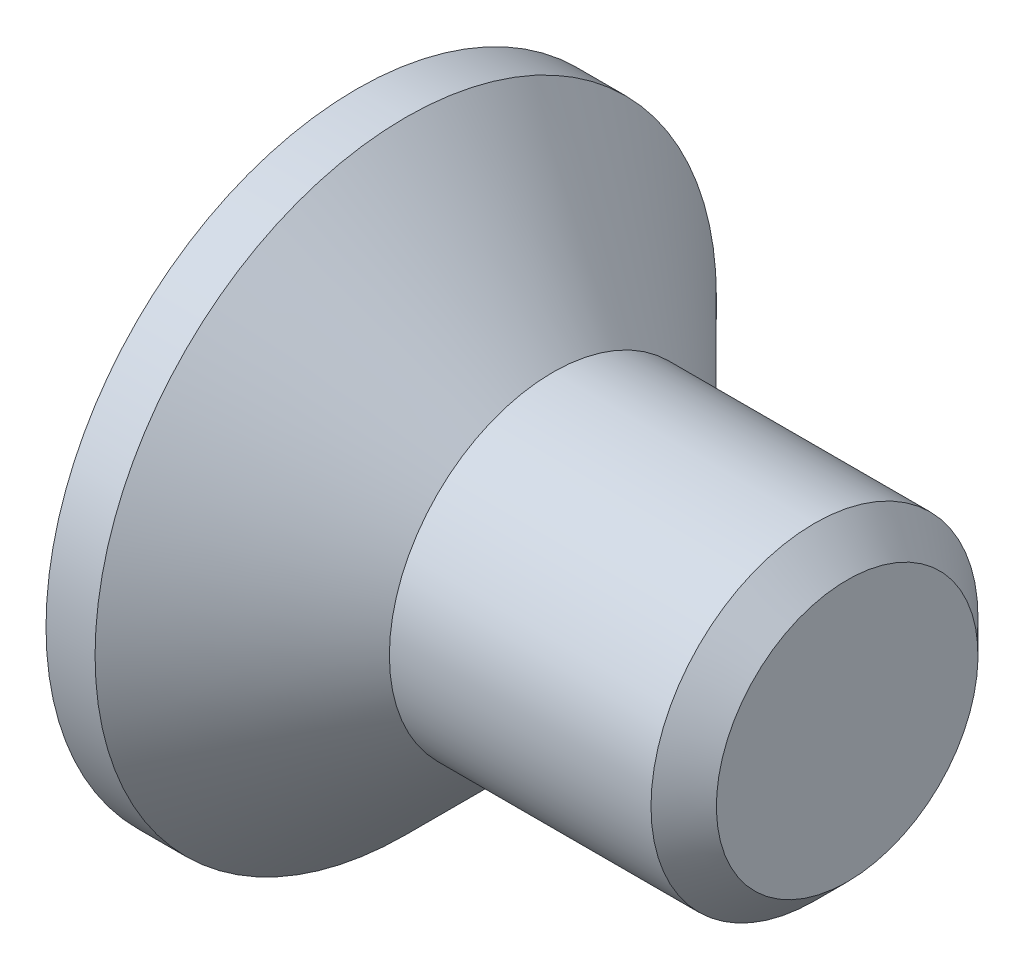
ISO-10303-21;
HEADER;
FILE_DESCRIPTION(('STEP AP214'),'2;1');
FILE_NAME('part.step','',(''),(''),'','','');
FILE_SCHEMA(('AUTOMOTIVE_DESIGN { 1 0 10303 214 1 1 1 1 }'));
ENDSEC;
DATA;
#1=APPLICATION_CONTEXT('core data for automotive mechanical design processes');
#2=APPLICATION_PROTOCOL_DEFINITION('international standard','automotive_design',2000,#1);
#3=PRODUCT_CONTEXT('',#1,'mechanical');
#4=PRODUCT('Part','Part','',(#3));
#5=PRODUCT_RELATED_PRODUCT_CATEGORY('part','',(#4));
#6=PRODUCT_DEFINITION_FORMATION('','',#4);
#7=PRODUCT_DEFINITION_CONTEXT('part definition',#1,'design');
#8=PRODUCT_DEFINITION('design','',#6,#7);
#9=PRODUCT_DEFINITION_SHAPE('','',#8);
#10=(LENGTH_UNIT() NAMED_UNIT(*) SI_UNIT(.MILLI.,.METRE.));
#11=(NAMED_UNIT(*) PLANE_ANGLE_UNIT() SI_UNIT($,.RADIAN.));
#12=(NAMED_UNIT(*) SI_UNIT($,.STERADIAN.) SOLID_ANGLE_UNIT());
#13=UNCERTAINTY_MEASURE_WITH_UNIT(LENGTH_MEASURE(1.E-05),#10,'distance_accuracy_value','');
#14=(GEOMETRIC_REPRESENTATION_CONTEXT(3) GLOBAL_UNCERTAINTY_ASSIGNED_CONTEXT((#13)) GLOBAL_UNIT_ASSIGNED_CONTEXT((#10,
#11,#12)) REPRESENTATION_CONTEXT('',''));
#15=CARTESIAN_POINT('',(0.,0.,0.));
#16=DIRECTION('',(0.,0.,1.));
#17=DIRECTION('',(1.,0.,0.));
#18=AXIS2_PLACEMENT_3D('',#15,#16,#17);
#19=CARTESIAN_POINT('',(0.,0.,0.));
#20=DIRECTION('',(-1.,0.,0.));
#21=DIRECTION('',(0.,-1.,0.));
#22=AXIS2_PLACEMENT_3D('',#19,#20,#21);
#23=CONICAL_SURFACE('',#22,1.,0.78539816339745);
#24=CARTESIAN_POINT('',(-0.899999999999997,0.,0.));
#25=DIRECTION('',(-1.,0.,0.));
#26=DIRECTION('',(0.,-1.,0.));
#27=AXIS2_PLACEMENT_3D('',#24,#25,#26);
#28=CIRCLE('',#27,1.9);
#29=CARTESIAN_POINT('',(-0.899999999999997,-1.9,0.));
#30=VERTEX_POINT('',#29);
#31=EDGE_CURVE('E189',#30,#30,#28,.T.);
#32=ORIENTED_EDGE('',*,*,#31,.F.);
#33=EDGE_LOOP('',(#32));
#34=FACE_BOUND('',#33,.T.);
#35=CARTESIAN_POINT('',(0.,0.,0.));
#36=DIRECTION('',(-1.,0.,0.));
#37=DIRECTION('',(0.,-1.,0.));
#38=AXIS2_PLACEMENT_3D('',#35,#36,#37);
#39=CIRCLE('',#38,1.);
#40=CARTESIAN_POINT('',(0.,-1.,0.));
#41=VERTEX_POINT('',#40);
#42=EDGE_CURVE('E212',#41,#41,#39,.T.);
#43=ORIENTED_EDGE('',*,*,#42,.T.);
#44=EDGE_LOOP('',(#43));
#45=FACE_BOUND('',#44,.T.);
#46=ADVANCED_FACE('F33',(#34,#45),#23,.T.);
#47=CARTESIAN_POINT('',(-1.2,0.,0.));
#48=DIRECTION('',(-1.,0.,0.));
#49=DIRECTION('',(0.,-1.,0.));
#50=AXIS2_PLACEMENT_3D('',#47,#48,#49);
#51=CYLINDRICAL_SURFACE('',#50,1.);
#52=CARTESIAN_POINT('',(1.6,0.,0.));
#53=DIRECTION('',(-1.,0.,0.));
#54=DIRECTION('',(0.,-1.,0.));
#55=AXIS2_PLACEMENT_3D('',#52,#53,#54);
#56=CIRCLE('',#55,1.);
#57=CARTESIAN_POINT('',(1.6,-1.,0.));
#58=VERTEX_POINT('',#57);
#59=EDGE_CURVE('E41',#58,#58,#56,.T.);
#60=ORIENTED_EDGE('',*,*,#59,.T.);
#61=EDGE_LOOP('',(#60));
#62=FACE_BOUND('',#61,.T.);
#63=ORIENTED_EDGE('',*,*,#42,.F.);
#64=EDGE_LOOP('',(#63));
#65=FACE_BOUND('',#64,.T.);
#66=ADVANCED_FACE('F217',(#62,#65),#51,.T.);
#67=CARTESIAN_POINT('',(1.8,0.,0.));
#68=DIRECTION('',(-1.,0.,0.));
#69=DIRECTION('',(0.,-1.,0.));
#70=AXIS2_PLACEMENT_3D('',#67,#68,#69);
#71=PLANE('',#70);
#72=CARTESIAN_POINT('',(1.8,0.,0.));
#73=DIRECTION('',(-1.,0.,0.));
#74=DIRECTION('',(0.,-1.,0.));
#75=AXIS2_PLACEMENT_3D('',#72,#73,#74);
#76=CIRCLE('',#75,0.800000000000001);
#77=CARTESIAN_POINT('',(1.8,-0.800000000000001,0.));
#78=VERTEX_POINT('',#77);
#79=EDGE_CURVE('E11',#78,#78,#76,.F.);
#80=ORIENTED_EDGE('',*,*,#79,.T.);
#81=EDGE_LOOP('',(#80));
#82=FACE_BOUND('',#81,.T.);
#83=ADVANCED_FACE('F240',(#82),#71,.F.);
#84=CARTESIAN_POINT('',(-1.2,1.9,0.));
#85=DIRECTION('',(1.,0.,0.));
#86=DIRECTION('',(0.,1.,0.));
#87=AXIS2_PLACEMENT_3D('',#84,#85,#86);
#88=PLANE('',#87);
#89=DIRECTION('',(0.,0.,-1.));
#90=VECTOR('',#89,1.);
#91=CARTESIAN_POINT('',(-1.2,0.3,-1.175));
#92=LINE('',#91,#90);
#93=CARTESIAN_POINT('',(-1.2,0.3,-0.3));
#94=VERTEX_POINT('',#93);
#95=CARTESIAN_POINT('',(-1.2,0.3,-1.175));
#96=VERTEX_POINT('',#95);
#97=EDGE_CURVE('E158',#94,#96,#92,.T.);
#98=ORIENTED_EDGE('',*,*,#97,.F.);
#99=DIRECTION('',(0.,-1.,0.));
#100=VECTOR('',#99,1.);
#101=CARTESIAN_POINT('',(-1.2,0.3,-0.3));
#102=LINE('',#101,#100);
#103=CARTESIAN_POINT('',(-1.2,1.175,-0.3));
#104=VERTEX_POINT('',#103);
#105=EDGE_CURVE('E48',#104,#94,#102,.T.);
#106=ORIENTED_EDGE('',*,*,#105,.F.);
#107=DIRECTION('',(0.,0.,-1.));
#108=VECTOR('',#107,1.);
#109=CARTESIAN_POINT('',(-1.2,1.175,-0.3));
#110=LINE('',#109,#108);
#111=CARTESIAN_POINT('',(-1.2,1.175,0.3));
#112=VERTEX_POINT('',#111);
#113=EDGE_CURVE('E185',#112,#104,#110,.T.);
#114=ORIENTED_EDGE('',*,*,#113,.F.);
#115=DIRECTION('',(0.,1.,0.));
#116=VECTOR('',#115,1.);
#117=CARTESIAN_POINT('',(-1.2,1.175,0.3));
#118=LINE('',#117,#116);
#119=CARTESIAN_POINT('',(-1.2,0.3,0.3));
#120=VERTEX_POINT('',#119);
#121=EDGE_CURVE('E183',#120,#112,#118,.T.);
#122=ORIENTED_EDGE('',*,*,#121,.F.);
#123=DIRECTION('',(0.,0.,-1.));
#124=VECTOR('',#123,1.);
#125=CARTESIAN_POINT('',(-1.2,0.3,0.3));
#126=LINE('',#125,#124);
#127=CARTESIAN_POINT('',(-1.2,0.3,1.175));
#128=VERTEX_POINT('',#127);
#129=EDGE_CURVE('E132',#128,#120,#126,.T.);
#130=ORIENTED_EDGE('',*,*,#129,.F.);
#131=DIRECTION('',(0.,1.,0.));
#132=VECTOR('',#131,1.);
#133=CARTESIAN_POINT('',(-1.2,0.3,1.175));
#134=LINE('',#133,#132);
#135=CARTESIAN_POINT('',(-1.2,-0.3,1.175));
#136=VERTEX_POINT('',#135);
#137=EDGE_CURVE('E179',#136,#128,#134,.T.);
#138=ORIENTED_EDGE('',*,*,#137,.F.);
#139=DIRECTION('',(0.,0.,1.));
#140=VECTOR('',#139,1.);
#141=CARTESIAN_POINT('',(-1.2,-0.3,1.175));
#142=LINE('',#141,#140);
#143=CARTESIAN_POINT('',(-1.2,-0.3,0.3));
#144=VERTEX_POINT('',#143);
#145=EDGE_CURVE('E176',#144,#136,#142,.T.);
#146=ORIENTED_EDGE('',*,*,#145,.F.);
#147=DIRECTION('',(0.,1.,0.));
#148=VECTOR('',#147,1.);
#149=CARTESIAN_POINT('',(-1.2,-0.3,0.3));
#150=LINE('',#149,#148);
#151=CARTESIAN_POINT('',(-1.2,-1.175,0.3));
#152=VERTEX_POINT('',#151);
#153=EDGE_CURVE('E173',#152,#144,#150,.T.);
#154=ORIENTED_EDGE('',*,*,#153,.F.);
#155=DIRECTION('',(0.,0.,1.));
#156=VECTOR('',#155,1.);
#157=CARTESIAN_POINT('',(-1.2,-1.175,0.3));
#158=LINE('',#157,#156);
#159=CARTESIAN_POINT('',(-1.2,-1.175,-0.3));
#160=VERTEX_POINT('',#159);
#161=EDGE_CURVE('E170',#160,#152,#158,.T.);
#162=ORIENTED_EDGE('',*,*,#161,.F.);
#163=DIRECTION('',(0.,-1.,0.));
#164=VECTOR('',#163,1.);
#165=CARTESIAN_POINT('',(-1.2,-1.175,-0.3));
#166=LINE('',#165,#164);
#167=CARTESIAN_POINT('',(-1.2,-0.3,-0.3));
#168=VERTEX_POINT('',#167);
#169=EDGE_CURVE('E167',#168,#160,#166,.T.);
#170=ORIENTED_EDGE('',*,*,#169,.F.);
#171=DIRECTION('',(0.,0.,1.));
#172=VECTOR('',#171,1.);
#173=CARTESIAN_POINT('',(-1.2,-0.3,-0.3));
#174=LINE('',#173,#172);
#175=CARTESIAN_POINT('',(-1.2,-0.3,-1.175));
#176=VERTEX_POINT('',#175);
#177=EDGE_CURVE('E164',#176,#168,#174,.T.);
#178=ORIENTED_EDGE('',*,*,#177,.F.);
#179=DIRECTION('',(0.,-1.,0.));
#180=VECTOR('',#179,1.);
#181=CARTESIAN_POINT('',(-1.2,-0.3,-1.175));
#182=LINE('',#181,#180);
#183=EDGE_CURVE('E161',#96,#176,#182,.T.);
#184=ORIENTED_EDGE('',*,*,#183,.F.);
#185=EDGE_LOOP('',(#98,#106,#114,#122,#130,#138,#146,#154,#162,#170,#178,#184));
#186=FACE_BOUND('',#185,.T.);
#187=CARTESIAN_POINT('',(-1.2,0.,0.));
#188=DIRECTION('',(-1.,0.,0.));
#189=DIRECTION('',(0.,-1.,0.));
#190=AXIS2_PLACEMENT_3D('',#187,#188,#189);
#191=CIRCLE('',#190,1.9);
#192=CARTESIAN_POINT('',(-1.2,-1.9,0.));
#193=VERTEX_POINT('',#192);
#194=EDGE_CURVE('E209',#193,#193,#191,.T.);
#195=ORIENTED_EDGE('',*,*,#194,.T.);
#196=EDGE_LOOP('',(#195));
#197=FACE_BOUND('',#196,.T.);
#198=ADVANCED_FACE('F230',(#186,#197),#88,.F.);
#199=CARTESIAN_POINT('',(-1.2,0.,0.));
#200=DIRECTION('',(-1.,0.,0.));
#201=DIRECTION('',(0.,-1.,0.));
#202=AXIS2_PLACEMENT_3D('',#199,#200,#201);
#203=CYLINDRICAL_SURFACE('',#202,1.9);
#204=ORIENTED_EDGE('',*,*,#194,.F.);
#205=EDGE_LOOP('',(#204));
#206=FACE_BOUND('',#205,.T.);
#207=ORIENTED_EDGE('',*,*,#31,.T.);
#208=EDGE_LOOP('',(#207));
#209=FACE_BOUND('',#208,.T.);
#210=ADVANCED_FACE('F222',(#206,#209),#203,.T.);
#211=CARTESIAN_POINT('',(1.6,0.,0.));
#212=DIRECTION('',(-1.,0.,0.));
#213=DIRECTION('',(0.,-1.,0.));
#214=AXIS2_PLACEMENT_3D('',#211,#212,#213);
#215=CONICAL_SURFACE('',#214,1.,0.785398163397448);
#216=CARTESIAN_POINT('',(1.8,-0.800000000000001,0.));
#217=CARTESIAN_POINT('',(1.79791666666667,-0.802083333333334,0.));
#218=CARTESIAN_POINT('',(1.79583333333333,-0.804166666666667,0.));
#219=CARTESIAN_POINT('',(1.79166666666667,-0.808333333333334,0.));
#220=CARTESIAN_POINT('',(1.78958333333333,-0.810416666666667,0.));
#221=CARTESIAN_POINT('',(1.78541666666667,-0.814583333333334,0.));
#222=CARTESIAN_POINT('',(1.78333333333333,-0.816666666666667,0.));
#223=CARTESIAN_POINT('',(1.77916666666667,-0.820833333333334,0.));
#224=CARTESIAN_POINT('',(1.77708333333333,-0.822916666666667,0.));
#225=CARTESIAN_POINT('',(1.77291666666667,-0.827083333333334,0.));
#226=CARTESIAN_POINT('',(1.77083333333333,-0.829166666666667,0.));
#227=CARTESIAN_POINT('',(1.76666666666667,-0.833333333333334,0.));
#228=CARTESIAN_POINT('',(1.76458333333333,-0.835416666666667,0.));
#229=CARTESIAN_POINT('',(1.76041666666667,-0.839583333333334,0.));
#230=CARTESIAN_POINT('',(1.75833333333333,-0.841666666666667,0.));
#231=CARTESIAN_POINT('',(1.75416666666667,-0.845833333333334,0.));
#232=CARTESIAN_POINT('',(1.75208333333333,-0.847916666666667,0.));
#233=CARTESIAN_POINT('',(1.74791666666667,-0.852083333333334,0.));
#234=CARTESIAN_POINT('',(1.74583333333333,-0.854166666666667,0.));
#235=CARTESIAN_POINT('',(1.74166666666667,-0.858333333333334,0.));
#236=CARTESIAN_POINT('',(1.73958333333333,-0.860416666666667,0.));
#237=CARTESIAN_POINT('',(1.73541666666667,-0.864583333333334,0.));
#238=CARTESIAN_POINT('',(1.73333333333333,-0.866666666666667,0.));
#239=CARTESIAN_POINT('',(1.72916666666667,-0.870833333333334,0.));
#240=CARTESIAN_POINT('',(1.72708333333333,-0.872916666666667,0.));
#241=CARTESIAN_POINT('',(1.72291666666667,-0.877083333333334,0.));
#242=CARTESIAN_POINT('',(1.72083333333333,-0.879166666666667,0.));
#243=CARTESIAN_POINT('',(1.71666666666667,-0.883333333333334,0.));
#244=CARTESIAN_POINT('',(1.71458333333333,-0.885416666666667,0.));
#245=CARTESIAN_POINT('',(1.71041666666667,-0.889583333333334,0.));
#246=CARTESIAN_POINT('',(1.70833333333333,-0.891666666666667,0.));
#247=CARTESIAN_POINT('',(1.70416666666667,-0.895833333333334,0.));
#248=CARTESIAN_POINT('',(1.70208333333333,-0.897916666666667,0.));
#249=CARTESIAN_POINT('',(1.69791666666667,-0.902083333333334,0.));
#250=CARTESIAN_POINT('',(1.69583333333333,-0.904166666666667,0.));
#251=CARTESIAN_POINT('',(1.69166666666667,-0.908333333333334,0.));
#252=CARTESIAN_POINT('',(1.68958333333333,-0.910416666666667,0.));
#253=CARTESIAN_POINT('',(1.68541666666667,-0.914583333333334,0.));
#254=CARTESIAN_POINT('',(1.68333333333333,-0.916666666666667,0.));
#255=CARTESIAN_POINT('',(1.67916666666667,-0.920833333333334,0.));
#256=CARTESIAN_POINT('',(1.67708333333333,-0.922916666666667,0.));
#257=CARTESIAN_POINT('',(1.67291666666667,-0.927083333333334,0.));
#258=CARTESIAN_POINT('',(1.67083333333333,-0.929166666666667,0.));
#259=CARTESIAN_POINT('',(1.66666666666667,-0.933333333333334,0.));
#260=CARTESIAN_POINT('',(1.66458333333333,-0.935416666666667,0.));
#261=CARTESIAN_POINT('',(1.66041666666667,-0.939583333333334,0.));
#262=CARTESIAN_POINT('',(1.65833333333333,-0.941666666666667,0.));
#263=CARTESIAN_POINT('',(1.65416666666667,-0.945833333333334,0.));
#264=CARTESIAN_POINT('',(1.65208333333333,-0.947916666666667,0.));
#265=CARTESIAN_POINT('',(1.64791666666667,-0.952083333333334,0.));
#266=CARTESIAN_POINT('',(1.64583333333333,-0.954166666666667,0.));
#267=CARTESIAN_POINT('',(1.64166666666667,-0.958333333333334,0.));
#268=CARTESIAN_POINT('',(1.63958333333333,-0.960416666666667,0.));
#269=CARTESIAN_POINT('',(1.63541666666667,-0.964583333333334,0.));
#270=CARTESIAN_POINT('',(1.63333333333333,-0.966666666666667,0.));
#271=CARTESIAN_POINT('',(1.62916666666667,-0.970833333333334,0.));
#272=CARTESIAN_POINT('',(1.62708333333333,-0.972916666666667,0.));
#273=CARTESIAN_POINT('',(1.62291666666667,-0.977083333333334,0.));
#274=CARTESIAN_POINT('',(1.62083333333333,-0.979166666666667,0.));
#275=CARTESIAN_POINT('',(1.61666666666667,-0.983333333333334,0.));
#276=CARTESIAN_POINT('',(1.61458333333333,-0.985416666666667,0.));
#277=CARTESIAN_POINT('',(1.61041666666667,-0.989583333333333,0.));
#278=CARTESIAN_POINT('',(1.60833333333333,-0.991666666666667,0.));
#279=CARTESIAN_POINT('',(1.60416666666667,-0.995833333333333,0.));
#280=CARTESIAN_POINT('',(1.60208333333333,-0.997916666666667,0.));
#281=CARTESIAN_POINT('',(1.6,-1.,0.));
#282=B_SPLINE_CURVE_WITH_KNOTS('',3,(#216,#217,#218,#219,#220,#221,#222,#223,#224,#225,#226,
#227,#228,#229,#230,#231,#232,#233,#234,#235,#236,#237,#238,#239,#240,#241,#242,#243,#244,#245,
#246,#247,#248,#249,#250,#251,#252,#253,#254,#255,#256,#257,#258,#259,#260,#261,#262,#263,#264,
#265,#266,#267,#268,#269,#270,#271,#272,#273,#274,#275,#276,#277,#278,#279,#280,#281),
.UNSPECIFIED.,.F.,.F.,(4,2,2,2,2,2,2,2,2,2,2,2,2,2,2,2,2,2,2,2,2,2,2,2,2,2,2,2,2,2,2,2,4),(0.,
0.00883883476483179,0.0176776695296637,0.0265165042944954,0.0353553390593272,0.044194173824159,
0.0530330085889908,0.0618718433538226,0.0707106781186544,0.0795495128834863,0.0883883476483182,
0.09722718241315,0.106066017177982,0.114904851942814,0.123743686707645,0.132582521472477,
0.141421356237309,0.150260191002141,0.159099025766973,0.167937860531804,0.176776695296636,
0.185615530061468,0.1944543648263,0.203293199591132,0.212132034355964,0.220970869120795,
0.229809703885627,0.238648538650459,0.247487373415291,0.256326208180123,0.265165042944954,
0.274003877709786,0.282842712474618),.UNSPECIFIED.);
#283=EDGE_CURVE('BSEAM35',#78,#58,#282,.T.);
#284=ORIENTED_EDGE('',*,*,#79,.F.);
#285=ORIENTED_EDGE('',*,*,#59,.F.);
#286=ORIENTED_EDGE('',*,*,#283,.T.);
#287=ORIENTED_EDGE('',*,*,#283,.F.);
#288=EDGE_LOOP('',(#284,#286,#285,#287));
#289=FACE_BOUND('',#288,.T.);
#290=ADVANCED_FACE('F35',(#289),#215,.T.);
#291=CARTESIAN_POINT('',(-0.249999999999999,0.3,-0.3));
#292=DIRECTION('',(0.,0.,-1.));
#293=DIRECTION('',(0.,1.,0.));
#294=AXIS2_PLACEMENT_3D('',#291,#292,#293);
#295=PLANE('',#294);
#296=ORIENTED_EDGE('',*,*,#105,.T.);
#297=DIRECTION('',(-1.,0.,0.));
#298=VECTOR('',#297,1.);
#299=CARTESIAN_POINT('',(-0.249999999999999,0.3,-0.3));
#300=LINE('',#299,#298);
#301=CARTESIAN_POINT('',(-0.249999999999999,0.3,-0.3));
#302=VERTEX_POINT('',#301);
#303=EDGE_CURVE('E96',#302,#94,#300,.T.);
#304=ORIENTED_EDGE('',*,*,#303,.F.);
#305=DIRECTION('',(0.,-1.,0.));
#306=VECTOR('',#305,1.);
#307=CARTESIAN_POINT('',(-0.249999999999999,0.3,-0.3));
#308=LINE('',#307,#306);
#309=CARTESIAN_POINT('',(-0.249999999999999,1.175,-0.3));
#310=VERTEX_POINT('',#309);
#311=EDGE_CURVE('E187',#310,#302,#308,.T.);
#312=ORIENTED_EDGE('',*,*,#311,.F.);
#313=DIRECTION('',(-1.,0.,0.));
#314=VECTOR('',#313,1.);
#315=CARTESIAN_POINT('',(-0.249999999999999,1.175,-0.3));
#316=LINE('',#315,#314);
#317=EDGE_CURVE('E56',#310,#104,#316,.T.);
#318=ORIENTED_EDGE('',*,*,#317,.T.);
#319=EDGE_LOOP('',(#296,#304,#312,#318));
#320=FACE_BOUND('',#319,.T.);
#321=ADVANCED_FACE('F221',(#320),#295,.F.);
#322=CARTESIAN_POINT('',(-0.249999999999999,1.175,-0.3));
#323=DIRECTION('',(0.,1.,0.));
#324=DIRECTION('',(-1.,0.,0.));
#325=AXIS2_PLACEMENT_3D('',#322,#323,#324);
#326=PLANE('',#325);
#327=ORIENTED_EDGE('',*,*,#113,.T.);
#328=ORIENTED_EDGE('',*,*,#317,.F.);
#329=DIRECTION('',(0.,0.,-1.));
#330=VECTOR('',#329,1.);
#331=CARTESIAN_POINT('',(-0.249999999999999,1.175,-0.3));
#332=LINE('',#331,#330);
#333=CARTESIAN_POINT('',(-0.249999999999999,1.175,0.3));
#334=VERTEX_POINT('',#333);
#335=EDGE_CURVE('E144',#334,#310,#332,.T.);
#336=ORIENTED_EDGE('',*,*,#335,.F.);
#337=DIRECTION('',(-1.,0.,0.));
#338=VECTOR('',#337,1.);
#339=CARTESIAN_POINT('',(-0.249999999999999,1.175,0.3));
#340=LINE('',#339,#338);
#341=EDGE_CURVE('E136',#334,#112,#340,.T.);
#342=ORIENTED_EDGE('',*,*,#341,.T.);
#343=EDGE_LOOP('',(#327,#328,#336,#342));
#344=FACE_BOUND('',#343,.T.);
#345=ADVANCED_FACE('F228',(#344),#326,.F.);
#346=CARTESIAN_POINT('',(-0.249999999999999,1.175,0.3));
#347=DIRECTION('',(0.,0.,1.));
#348=DIRECTION('',(0.,-1.,0.));
#349=AXIS2_PLACEMENT_3D('',#346,#347,#348);
#350=PLANE('',#349);
#351=ORIENTED_EDGE('',*,*,#121,.T.);
#352=ORIENTED_EDGE('',*,*,#341,.F.);
#353=DIRECTION('',(0.,1.,0.));
#354=VECTOR('',#353,1.);
#355=CARTESIAN_POINT('',(-0.249999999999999,1.175,0.3));
#356=LINE('',#355,#354);
#357=CARTESIAN_POINT('',(-0.249999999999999,0.3,0.3));
#358=VERTEX_POINT('',#357);
#359=EDGE_CURVE('E140',#358,#334,#356,.T.);
#360=ORIENTED_EDGE('',*,*,#359,.F.);
#361=DIRECTION('',(-1.,0.,0.));
#362=VECTOR('',#361,1.);
#363=CARTESIAN_POINT('',(-0.249999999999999,0.3,0.3));
#364=LINE('',#363,#362);
#365=EDGE_CURVE('E125',#358,#120,#364,.T.);
#366=ORIENTED_EDGE('',*,*,#365,.T.);
#367=EDGE_LOOP('',(#351,#352,#360,#366));
#368=FACE_BOUND('',#367,.T.);
#369=ADVANCED_FACE('F141',(#368),#350,.F.);
#370=CARTESIAN_POINT('',(-0.249999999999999,0.3,0.3));
#371=DIRECTION('',(0.,1.,0.));
#372=DIRECTION('',(0.,0.,1.));
#373=AXIS2_PLACEMENT_3D('',#370,#371,#372);
#374=PLANE('',#373);
#375=ORIENTED_EDGE('',*,*,#129,.T.);
#376=ORIENTED_EDGE('',*,*,#365,.F.);
#377=DIRECTION('',(0.,0.,-1.));
#378=VECTOR('',#377,1.);
#379=CARTESIAN_POINT('',(-0.249999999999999,0.3,0.3));
#380=LINE('',#379,#378);
#381=CARTESIAN_POINT('',(-0.249999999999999,0.3,1.175));
#382=VERTEX_POINT('',#381);
#383=EDGE_CURVE('E129',#382,#358,#380,.T.);
#384=ORIENTED_EDGE('',*,*,#383,.F.);
#385=DIRECTION('',(-1.,0.,0.));
#386=VECTOR('',#385,1.);
#387=CARTESIAN_POINT('',(-0.249999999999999,0.3,1.175));
#388=LINE('',#387,#386);
#389=EDGE_CURVE('E137',#382,#128,#388,.T.);
#390=ORIENTED_EDGE('',*,*,#389,.T.);
#391=EDGE_LOOP('',(#375,#376,#384,#390));
#392=FACE_BOUND('',#391,.T.);
#393=ADVANCED_FACE('F127',(#392),#374,.F.);
#394=CARTESIAN_POINT('',(-0.249999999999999,0.3,1.175));
#395=DIRECTION('',(0.,0.,1.));
#396=DIRECTION('',(1.,0.,0.));
#397=AXIS2_PLACEMENT_3D('',#394,#395,#396);
#398=PLANE('',#397);
#399=ORIENTED_EDGE('',*,*,#137,.T.);
#400=ORIENTED_EDGE('',*,*,#389,.F.);
#401=DIRECTION('',(0.,1.,0.));
#402=VECTOR('',#401,1.);
#403=CARTESIAN_POINT('',(-0.249999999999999,0.3,1.175));
#404=LINE('',#403,#402);
#405=CARTESIAN_POINT('',(-0.249999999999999,-0.3,1.175));
#406=VERTEX_POINT('',#405);
#407=EDGE_CURVE('E150',#406,#382,#404,.T.);
#408=ORIENTED_EDGE('',*,*,#407,.F.);
#409=DIRECTION('',(-1.,0.,0.));
#410=VECTOR('',#409,1.);
#411=CARTESIAN_POINT('',(-0.249999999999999,-0.3,1.175));
#412=LINE('',#411,#410);
#413=EDGE_CURVE('E192',#406,#136,#412,.T.);
#414=ORIENTED_EDGE('',*,*,#413,.T.);
#415=EDGE_LOOP('',(#399,#400,#408,#414));
#416=FACE_BOUND('',#415,.T.);
#417=ADVANCED_FACE('F278',(#416),#398,.F.);
#418=CARTESIAN_POINT('',(-0.249999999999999,-0.3,1.175));
#419=DIRECTION('',(0.,-1.,0.));
#420=DIRECTION('',(0.,0.,-1.));
#421=AXIS2_PLACEMENT_3D('',#418,#419,#420);
#422=PLANE('',#421);
#423=ORIENTED_EDGE('',*,*,#145,.T.);
#424=ORIENTED_EDGE('',*,*,#413,.F.);
#425=DIRECTION('',(0.,0.,1.));
#426=VECTOR('',#425,1.);
#427=CARTESIAN_POINT('',(-0.249999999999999,-0.3,1.175));
#428=LINE('',#427,#426);
#429=CARTESIAN_POINT('',(-0.249999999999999,-0.3,0.3));
#430=VERTEX_POINT('',#429);
#431=EDGE_CURVE('E152',#430,#406,#428,.T.);
#432=ORIENTED_EDGE('',*,*,#431,.F.);
#433=DIRECTION('',(-1.,0.,0.));
#434=VECTOR('',#433,1.);
#435=CARTESIAN_POINT('',(-0.249999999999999,-0.3,0.3));
#436=LINE('',#435,#434);
#437=EDGE_CURVE('E194',#430,#144,#436,.T.);
#438=ORIENTED_EDGE('',*,*,#437,.T.);
#439=EDGE_LOOP('',(#423,#424,#432,#438));
#440=FACE_BOUND('',#439,.T.);
#441=ADVANCED_FACE('F274',(#440),#422,.F.);
#442=CARTESIAN_POINT('',(-0.249999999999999,-0.3,0.3));
#443=DIRECTION('',(0.,0.,1.));
#444=DIRECTION('',(1.,0.,0.));
#445=AXIS2_PLACEMENT_3D('',#442,#443,#444);
#446=PLANE('',#445);
#447=ORIENTED_EDGE('',*,*,#153,.T.);
#448=ORIENTED_EDGE('',*,*,#437,.F.);
#449=DIRECTION('',(0.,1.,0.));
#450=VECTOR('',#449,1.);
#451=CARTESIAN_POINT('',(-0.249999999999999,-0.3,0.3));
#452=LINE('',#451,#450);
#453=CARTESIAN_POINT('',(-0.249999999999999,-1.175,0.3));
#454=VERTEX_POINT('',#453);
#455=EDGE_CURVE('E422',#454,#430,#452,.T.);
#456=ORIENTED_EDGE('',*,*,#455,.F.);
#457=DIRECTION('',(-1.,0.,0.));
#458=VECTOR('',#457,1.);
#459=CARTESIAN_POINT('',(-0.249999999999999,-1.175,0.3));
#460=LINE('',#459,#458);
#461=EDGE_CURVE('E196',#454,#152,#460,.T.);
#462=ORIENTED_EDGE('',*,*,#461,.T.);
#463=EDGE_LOOP('',(#447,#448,#456,#462));
#464=FACE_BOUND('',#463,.T.);
#465=ADVANCED_FACE('F270',(#464),#446,.F.);
#466=CARTESIAN_POINT('',(-0.249999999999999,-1.175,0.3));
#467=DIRECTION('',(0.,-1.,0.));
#468=DIRECTION('',(1.,0.,0.));
#469=AXIS2_PLACEMENT_3D('',#466,#467,#468);
#470=PLANE('',#469);
#471=ORIENTED_EDGE('',*,*,#161,.T.);
#472=ORIENTED_EDGE('',*,*,#461,.F.);
#473=DIRECTION('',(0.,0.,1.));
#474=VECTOR('',#473,1.);
#475=CARTESIAN_POINT('',(-0.249999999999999,-1.175,0.3));
#476=LINE('',#475,#474);
#477=CARTESIAN_POINT('',(-0.249999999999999,-1.175,-0.3));
#478=VERTEX_POINT('',#477);
#479=EDGE_CURVE('E419',#478,#454,#476,.T.);
#480=ORIENTED_EDGE('',*,*,#479,.F.);
#481=DIRECTION('',(-1.,0.,0.));
#482=VECTOR('',#481,1.);
#483=CARTESIAN_POINT('',(-0.249999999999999,-1.175,-0.3));
#484=LINE('',#483,#482);
#485=EDGE_CURVE('E198',#478,#160,#484,.T.);
#486=ORIENTED_EDGE('',*,*,#485,.T.);
#487=EDGE_LOOP('',(#471,#472,#480,#486));
#488=FACE_BOUND('',#487,.T.);
#489=ADVANCED_FACE('F266',(#488),#470,.F.);
#490=CARTESIAN_POINT('',(-0.249999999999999,-1.175,-0.3));
#491=DIRECTION('',(0.,0.,-1.));
#492=DIRECTION('',(0.,1.,0.));
#493=AXIS2_PLACEMENT_3D('',#490,#491,#492);
#494=PLANE('',#493);
#495=ORIENTED_EDGE('',*,*,#169,.T.);
#496=ORIENTED_EDGE('',*,*,#485,.F.);
#497=DIRECTION('',(0.,-1.,0.));
#498=VECTOR('',#497,1.);
#499=CARTESIAN_POINT('',(-0.249999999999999,-1.175,-0.3));
#500=LINE('',#499,#498);
#501=CARTESIAN_POINT('',(-0.249999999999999,-0.3,-0.3));
#502=VERTEX_POINT('',#501);
#503=EDGE_CURVE('E416',#502,#478,#500,.T.);
#504=ORIENTED_EDGE('',*,*,#503,.F.);
#505=DIRECTION('',(-1.,0.,0.));
#506=VECTOR('',#505,1.);
#507=CARTESIAN_POINT('',(-0.249999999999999,-0.3,-0.3));
#508=LINE('',#507,#506);
#509=EDGE_CURVE('E200',#502,#168,#508,.T.);
#510=ORIENTED_EDGE('',*,*,#509,.T.);
#511=EDGE_LOOP('',(#495,#496,#504,#510));
#512=FACE_BOUND('',#511,.T.);
#513=ADVANCED_FACE('F262',(#512),#494,.F.);
#514=CARTESIAN_POINT('',(-0.249999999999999,-0.3,-0.3));
#515=DIRECTION('',(0.,-1.,0.));
#516=DIRECTION('',(0.,0.,-1.));
#517=AXIS2_PLACEMENT_3D('',#514,#515,#516);
#518=PLANE('',#517);
#519=ORIENTED_EDGE('',*,*,#177,.T.);
#520=ORIENTED_EDGE('',*,*,#509,.F.);
#521=DIRECTION('',(0.,0.,1.));
#522=VECTOR('',#521,1.);
#523=CARTESIAN_POINT('',(-0.249999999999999,-0.3,-0.3));
#524=LINE('',#523,#522);
#525=CARTESIAN_POINT('',(-0.249999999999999,-0.3,-1.175));
#526=VERTEX_POINT('',#525);
#527=EDGE_CURVE('E413',#526,#502,#524,.T.);
#528=ORIENTED_EDGE('',*,*,#527,.F.);
#529=DIRECTION('',(-1.,0.,0.));
#530=VECTOR('',#529,1.);
#531=CARTESIAN_POINT('',(-0.249999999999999,-0.3,-1.175));
#532=LINE('',#531,#530);
#533=EDGE_CURVE('E202',#526,#176,#532,.T.);
#534=ORIENTED_EDGE('',*,*,#533,.T.);
#535=EDGE_LOOP('',(#519,#520,#528,#534));
#536=FACE_BOUND('',#535,.T.);
#537=ADVANCED_FACE('F258',(#536),#518,.F.);
#538=CARTESIAN_POINT('',(-0.249999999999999,-0.3,-1.175));
#539=DIRECTION('',(0.,0.,-1.));
#540=DIRECTION('',(-1.,0.,0.));
#541=AXIS2_PLACEMENT_3D('',#538,#539,#540);
#542=PLANE('',#541);
#543=ORIENTED_EDGE('',*,*,#183,.T.);
#544=ORIENTED_EDGE('',*,*,#533,.F.);
#545=DIRECTION('',(0.,-1.,0.));
#546=VECTOR('',#545,1.);
#547=CARTESIAN_POINT('',(-0.249999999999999,-0.3,-1.175));
#548=LINE('',#547,#546);
#549=CARTESIAN_POINT('',(-0.249999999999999,0.3,-1.175));
#550=VERTEX_POINT('',#549);
#551=EDGE_CURVE('E408',#550,#526,#548,.T.);
#552=ORIENTED_EDGE('',*,*,#551,.F.);
#553=DIRECTION('',(-1.,0.,0.));
#554=VECTOR('',#553,1.);
#555=CARTESIAN_POINT('',(-0.249999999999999,0.3,-1.175));
#556=LINE('',#555,#554);
#557=EDGE_CURVE('E204',#550,#96,#556,.T.);
#558=ORIENTED_EDGE('',*,*,#557,.T.);
#559=EDGE_LOOP('',(#543,#544,#552,#558));
#560=FACE_BOUND('',#559,.T.);
#561=ADVANCED_FACE('F254',(#560),#542,.F.);
#562=CARTESIAN_POINT('',(-0.249999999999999,0.3,-1.175));
#563=DIRECTION('',(0.,1.,0.));
#564=DIRECTION('',(0.,0.,1.));
#565=AXIS2_PLACEMENT_3D('',#562,#563,#564);
#566=PLANE('',#565);
#567=ORIENTED_EDGE('',*,*,#97,.T.);
#568=ORIENTED_EDGE('',*,*,#557,.F.);
#569=DIRECTION('',(0.,0.,-1.));
#570=VECTOR('',#569,1.);
#571=CARTESIAN_POINT('',(-0.249999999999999,0.3,-1.175));
#572=LINE('',#571,#570);
#573=EDGE_CURVE('E406',#302,#550,#572,.T.);
#574=ORIENTED_EDGE('',*,*,#573,.F.);
#575=ORIENTED_EDGE('',*,*,#303,.T.);
#576=EDGE_LOOP('',(#567,#568,#574,#575));
#577=FACE_BOUND('',#576,.T.);
#578=ADVANCED_FACE('F251',(#577),#566,.F.);
#579=CARTESIAN_POINT('',(-0.249999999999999,0.,0.));
#580=DIRECTION('',(1.,0.,0.));
#581=DIRECTION('',(0.,0.,-1.));
#582=AXIS2_PLACEMENT_3D('',#579,#580,#581);
#583=PLANE('',#582);
#584=ORIENTED_EDGE('',*,*,#311,.T.);
#585=ORIENTED_EDGE('',*,*,#573,.T.);
#586=ORIENTED_EDGE('',*,*,#551,.T.);
#587=ORIENTED_EDGE('',*,*,#527,.T.);
#588=ORIENTED_EDGE('',*,*,#503,.T.);
#589=ORIENTED_EDGE('',*,*,#479,.T.);
#590=ORIENTED_EDGE('',*,*,#455,.T.);
#591=ORIENTED_EDGE('',*,*,#431,.T.);
#592=ORIENTED_EDGE('',*,*,#407,.T.);
#593=ORIENTED_EDGE('',*,*,#383,.T.);
#594=ORIENTED_EDGE('',*,*,#359,.T.);
#595=ORIENTED_EDGE('',*,*,#335,.T.);
#596=EDGE_LOOP('',(#584,#585,#586,#587,#588,#589,#590,#591,#592,#593,#594,#595));
#597=FACE_BOUND('',#596,.T.);
#598=ADVANCED_FACE('F147',(#597),#583,.F.);
#599=CLOSED_SHELL('',(#46,#66,#83,#198,#210,#290,#321,#345,#369,#393,#417,#441,#465,#489,#513,
#537,#561,#578,#598));
#600=MANIFOLD_SOLID_BREP('B2',#599);
#601=ADVANCED_BREP_SHAPE_REPRESENTATION('',(#18,#600),#14);
#602=SHAPE_DEFINITION_REPRESENTATION(#9,#601);
ENDSEC;
END-ISO-10303-21;
